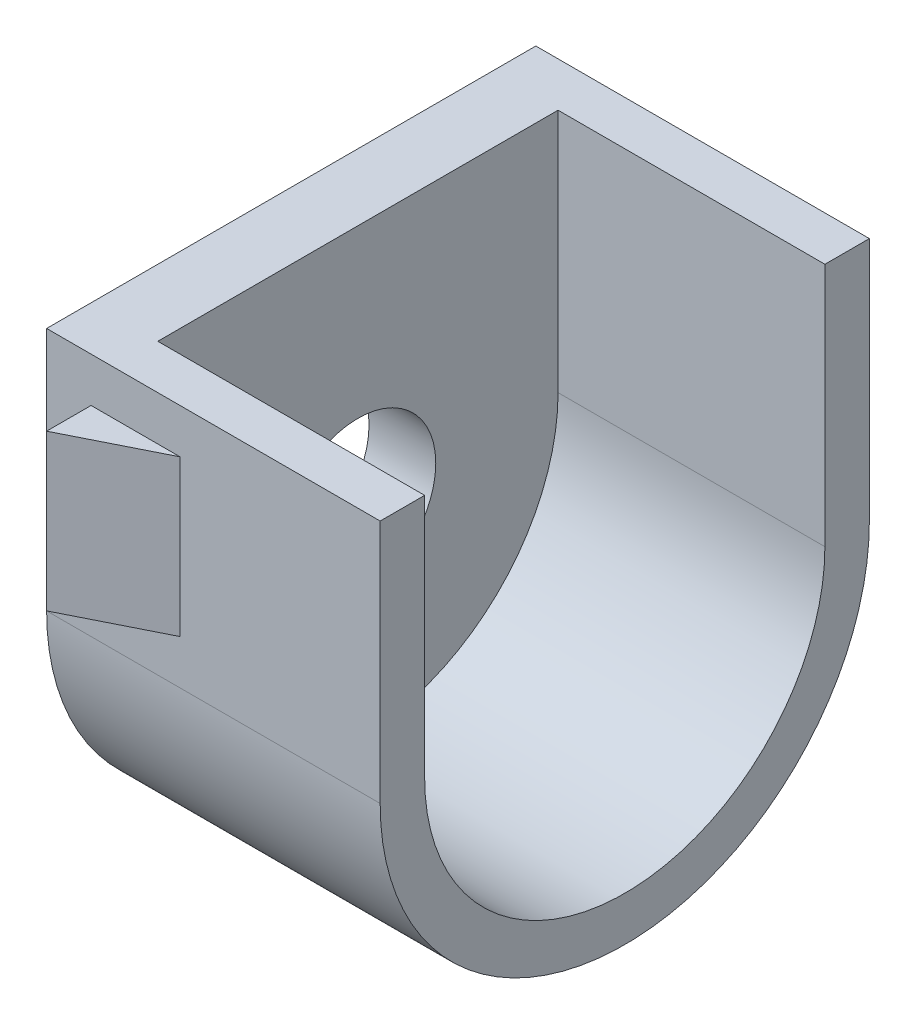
from build123d import *

# Parameters (mm, degrees)
BOSS_EXTRUDE2_DEPTH = 15
CUT_EXTRUDE1_DEPTH  = 12
SKETCH3_R           = 3.5
CUT_EXTRUDE2_DEPTH  = 20.646882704
SKETCH4_W           = 4
SKETCH4_H           = 7
BOSS_EXTRUDE3_DEPTH = 2
CUT_EXTRUDE3_DEPTH  = 29.178005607
SKETCH6_W           = 4
SKETCH6_H           = 7
BOSS_EXTRUDE4_DEPTH = 2
CUT_EXTRUDE4_DEPTH  = 24.727621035


with BuildPart() as part:
    # Sketch1 → Boss-Extrude2 (new body)
    with BuildSketch(Plane(origin=(0, 0, 0), x_dir=(0, 0, -1), z_dir=(1, 0, 0))):
        with BuildLine():
            Line((-11, 0), (-11, 11))
            Line((-11, 11), (11, 11))
            Line((11, 11), (11, 0))
            ThreePointArc((11, 0), (0, -11), (-11, 0))
        make_face()
    extrude(amount=BOSS_EXTRUDE2_DEPTH)

    # Sketch2 → Cut-Extrude1 (cut)
    with BuildSketch(Plane(origin=(15, 0, 0), x_dir=(0, 0, -1), z_dir=(1, 0, 0))):
        with BuildLine():
            Line((-9, 0), (-9, 11))
            Line((-9, 11), (9, 11))
            Line((9, 11), (9, 0))
            ThreePointArc((9, 0), (0, -9), (-9, 0))
        make_face()
    extrude(amount=-CUT_EXTRUDE1_DEPTH, mode=Mode.SUBTRACT)

    # Sketch3 → Cut-Extrude2 (cut, through all)
    with BuildSketch(Plane(origin=(3, 0, 0), x_dir=(0, 0, -1), z_dir=(1, 0, 0))):
        Circle(SKETCH3_R)
    extrude(amount=-CUT_EXTRUDE2_DEPTH, mode=Mode.SUBTRACT)

    # Sketch4 → Boss-Extrude3 (add)
    with BuildSketch(Plane(origin=(0, 0, -11), x_dir=(-1, 0, 0), z_dir=(0, 0, -1))):
        with Locations((-4, 5.5)):
            Rectangle(SKETCH4_W, SKETCH4_H)
    extrude(amount=BOSS_EXTRUDE3_DEPTH)

    # Sketch5 → Cut-Extrude3 (cut, through all)
    with BuildSketch(Plane(origin=(0, 9, 0), x_dir=(1, 0, 0), z_dir=(0, 1, 0))):
        Polygon((2, 13), (6, 11), (6, 13), align=None)
    extrude(amount=-CUT_EXTRUDE3_DEPTH, mode=Mode.SUBTRACT)

    # Sketch6 → Boss-Extrude4 (add)
    with BuildSketch(Plane.XY.offset(11)):
        with Locations((4, 5.5)):
            Rectangle(SKETCH6_W, SKETCH6_H)
    extrude(amount=BOSS_EXTRUDE4_DEPTH)

    # Sketch7 → Cut-Extrude4 (cut, through all)
    with BuildSketch(Plane.XZ.offset(-2)):
        Polygon((2, 13), (6, 11), (6, 13), align=None)
    extrude(amount=-CUT_EXTRUDE4_DEPTH, mode=Mode.SUBTRACT)


solid = part.part
